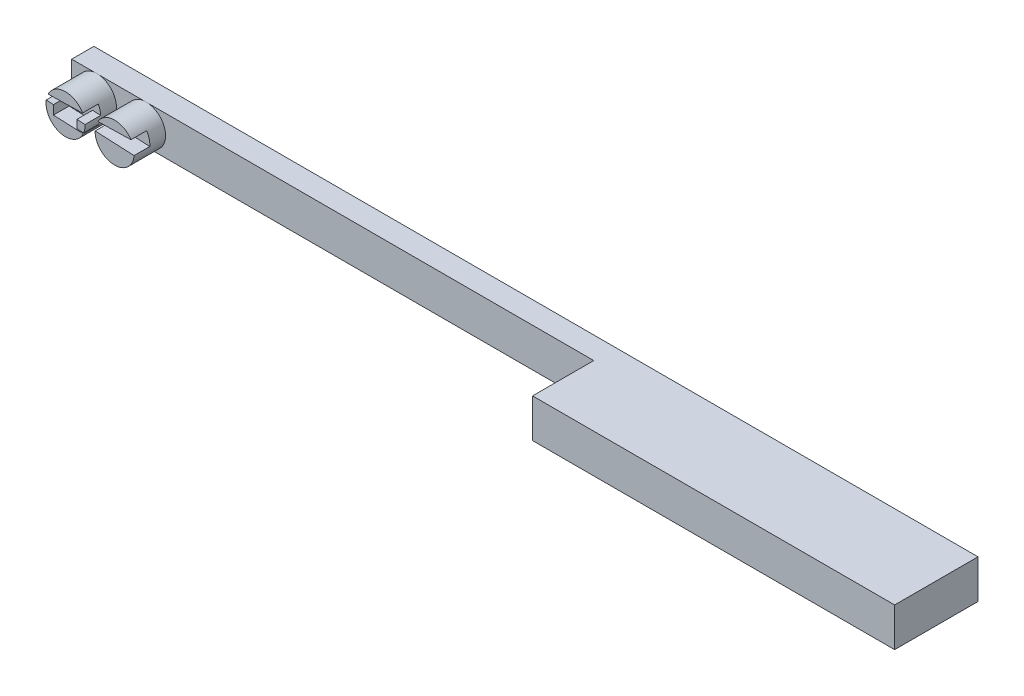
ISO-10303-21;
HEADER;
FILE_DESCRIPTION(('STEP AP214'),'2;1');
FILE_NAME('part.step','',(''),(''),'','','');
FILE_SCHEMA(('AUTOMOTIVE_DESIGN { 1 0 10303 214 1 1 1 1 }'));
ENDSEC;
DATA;
#1=APPLICATION_CONTEXT('core data for automotive mechanical design processes');
#2=APPLICATION_PROTOCOL_DEFINITION('international standard','automotive_design',2000,#1);
#3=PRODUCT_CONTEXT('',#1,'mechanical');
#4=PRODUCT('Part','Part','',(#3));
#5=PRODUCT_RELATED_PRODUCT_CATEGORY('part','',(#4));
#6=PRODUCT_DEFINITION_FORMATION('','',#4);
#7=PRODUCT_DEFINITION_CONTEXT('part definition',#1,'design');
#8=PRODUCT_DEFINITION('design','',#6,#7);
#9=PRODUCT_DEFINITION_SHAPE('','',#8);
#10=(LENGTH_UNIT() NAMED_UNIT(*) SI_UNIT(.MILLI.,.METRE.));
#11=(NAMED_UNIT(*) PLANE_ANGLE_UNIT() SI_UNIT($,.RADIAN.));
#12=(NAMED_UNIT(*) SI_UNIT($,.STERADIAN.) SOLID_ANGLE_UNIT());
#13=UNCERTAINTY_MEASURE_WITH_UNIT(LENGTH_MEASURE(1.E-05),#10,'distance_accuracy_value','');
#14=(GEOMETRIC_REPRESENTATION_CONTEXT(3) GLOBAL_UNCERTAINTY_ASSIGNED_CONTEXT((#13)) GLOBAL_UNIT_ASSIGNED_CONTEXT((#10,
#11,#12)) REPRESENTATION_CONTEXT('',''));
#15=CARTESIAN_POINT('',(0.,0.,0.));
#16=DIRECTION('',(0.,0.,1.));
#17=DIRECTION('',(1.,0.,0.));
#18=AXIS2_PLACEMENT_3D('',#15,#16,#17);
#19=CARTESIAN_POINT('',(-53.086,0.,3.8481));
#20=DIRECTION('',(0.,0.,1.));
#21=DIRECTION('',(1.,0.,0.));
#22=AXIS2_PLACEMENT_3D('',#19,#20,#21);
#23=PLANE('',#22);
#24=DIRECTION('',(-0.999733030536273,-0.0231055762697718,0.));
#25=VECTOR('',#24,1.);
#26=CARTESIAN_POINT('',(-35.97402,1.22303571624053,3.8481));
#27=LINE('',#26,#25);
#28=CARTESIAN_POINT('',(-51.5461047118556,0.863137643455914,3.8481));
#29=VERTEX_POINT('',#28);
#30=CARTESIAN_POINT('',(-54.6641270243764,0.791074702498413,3.8481));
#31=VERTEX_POINT('',#30);
#32=EDGE_CURVE('E322',#29,#31,#27,.T.);
#33=ORIENTED_EDGE('',*,*,#32,.F.);
#34=CARTESIAN_POINT('',(-53.086,0.,3.8481));
#35=DIRECTION('',(0.,0.,1.));
#36=DIRECTION('',(1.,0.,0.));
#37=AXIS2_PLACEMENT_3D('',#34,#35,#36);
#38=CIRCLE('',#37,1.7653);
#39=EDGE_CURVE('E221',#29,#31,#38,.T.);
#40=ORIENTED_EDGE('',*,*,#39,.T.);
#41=EDGE_LOOP('',(#33,#40));
#42=FACE_BOUND('',#41,.T.);
#43=ADVANCED_FACE('F34',(#42),#23,.T.);
#44=CARTESIAN_POINT('',(-48.641,0.,3.8481));
#45=DIRECTION('',(0.,0.,1.));
#46=DIRECTION('',(1.,0.,0.));
#47=AXIS2_PLACEMENT_3D('',#44,#45,#46);
#48=PLANE('',#47);
#49=DIRECTION('',(-0.999733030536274,-0.0231055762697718,0.));
#50=VECTOR('',#49,1.);
#51=CARTESIAN_POINT('',(-48.6624889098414,0.929783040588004,3.8481));
#52=LINE('',#51,#50);
#53=CARTESIAN_POINT('',(-47.1624476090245,0.96445161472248,3.8481));
#54=VERTEX_POINT('',#53);
#55=CARTESIAN_POINT('',(-50.1625302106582,0.895114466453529,3.8481));
#56=VERTEX_POINT('',#55);
#57=EDGE_CURVE('E294',#54,#56,#52,.T.);
#58=ORIENTED_EDGE('',*,*,#57,.F.);
#59=CARTESIAN_POINT('',(-48.641,0.,3.8481));
#60=DIRECTION('',(0.,0.,1.));
#61=DIRECTION('',(1.,0.,0.));
#62=AXIS2_PLACEMENT_3D('',#59,#60,#61);
#63=CIRCLE('',#62,1.76530000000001);
#64=EDGE_CURVE('E344',#54,#56,#63,.T.);
#65=ORIENTED_EDGE('',*,*,#64,.T.);
#66=EDGE_LOOP('',(#58,#65));
#67=FACE_BOUND('',#66,.T.);
#68=ADVANCED_FACE('F413',(#67),#48,.T.);
#69=CARTESIAN_POINT('',(-55.372,1.7526,1.0033));
#70=DIRECTION('',(0.,0.,-1.));
#71=DIRECTION('',(-1.,0.,0.));
#72=AXIS2_PLACEMENT_3D('',#69,#70,#71);
#73=PLANE('',#72);
#74=CARTESIAN_POINT('',(-48.641,0.,1.0033));
#75=DIRECTION('',(0.,0.,1.));
#76=DIRECTION('',(1.,0.,0.));
#77=AXIS2_PLACEMENT_3D('',#74,#75,#76);
#78=CIRCLE('',#77,1.76530000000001);
#79=CARTESIAN_POINT('',(-48.4296298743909,-1.7526,1.0033));
#80=VERTEX_POINT('',#79);
#81=CARTESIAN_POINT('',(-48.4296298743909,1.7526,1.0033));
#82=VERTEX_POINT('',#81);
#83=EDGE_CURVE('E343',#80,#82,#78,.T.);
#84=ORIENTED_EDGE('',*,*,#83,.F.);
#85=DIRECTION('',(1.,0.,0.));
#86=VECTOR('',#85,1.);
#87=CARTESIAN_POINT('',(-55.372,-1.7526,1.0033));
#88=LINE('',#87,#86);
#89=CARTESIAN_POINT('',(-8.128,-1.7526,1.0033));
#90=VERTEX_POINT('',#89);
#91=EDGE_CURVE('E261',#80,#90,#88,.T.);
#92=ORIENTED_EDGE('',*,*,#91,.T.);
#93=DIRECTION('',(0.,-1.,0.));
#94=VECTOR('',#93,1.);
#95=CARTESIAN_POINT('',(-8.128,1.7526,1.0033));
#96=LINE('',#95,#94);
#97=CARTESIAN_POINT('',(-8.128,1.7526,1.0033));
#98=VERTEX_POINT('',#97);
#99=EDGE_CURVE('E279',#98,#90,#96,.T.);
#100=ORIENTED_EDGE('',*,*,#99,.F.);
#101=DIRECTION('',(1.,0.,0.));
#102=VECTOR('',#101,1.);
#103=CARTESIAN_POINT('',(-55.372,1.7526,1.0033));
#104=LINE('',#103,#102);
#105=EDGE_CURVE('E245',#82,#98,#104,.T.);
#106=ORIENTED_EDGE('',*,*,#105,.F.);
#107=EDGE_LOOP('',(#84,#92,#100,#106));
#108=FACE_BOUND('',#107,.T.);
#109=ADVANCED_FACE('F418',(#108),#73,.F.);
#110=CARTESIAN_POINT('',(-48.8523701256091,1.7526,1.0033));
#111=VERTEX_POINT('',#110);
#112=CARTESIAN_POINT('',(-48.8523701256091,-1.7526,1.0033));
#113=VERTEX_POINT('',#112);
#114=EDGE_CURVE('E352',#111,#113,#78,.T.);
#115=ORIENTED_EDGE('',*,*,#114,.F.);
#116=CARTESIAN_POINT('',(-52.8746298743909,1.7526,1.0033));
#117=VERTEX_POINT('',#116);
#118=EDGE_CURVE('E250',#117,#111,#104,.T.);
#119=ORIENTED_EDGE('',*,*,#118,.F.);
#120=CARTESIAN_POINT('',(-53.086,0.,1.0033));
#121=DIRECTION('',(0.,0.,1.));
#122=DIRECTION('',(1.,0.,0.));
#123=AXIS2_PLACEMENT_3D('',#120,#121,#122);
#124=CIRCLE('',#123,1.7653);
#125=CARTESIAN_POINT('',(-52.8746298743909,-1.7526,1.0033));
#126=VERTEX_POINT('',#125);
#127=EDGE_CURVE('E235',#126,#117,#124,.T.);
#128=ORIENTED_EDGE('',*,*,#127,.F.);
#129=EDGE_CURVE('E709',#126,#113,#88,.T.);
#130=ORIENTED_EDGE('',*,*,#129,.T.);
#131=EDGE_LOOP('',(#115,#119,#128,#130));
#132=FACE_BOUND('',#131,.T.);
#133=ADVANCED_FACE('F425',(#132),#73,.F.);
#134=DIRECTION('',(0.99884275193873,-0.0480952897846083,0.));
#135=VECTOR('',#134,1.);
#136=CARTESIAN_POINT('',(-62.4332,0.611517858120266,3.8481));
#137=LINE('',#136,#135);
#138=CARTESIAN_POINT('',(-52.0598400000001,0.112030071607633,3.8481));
#139=VERTEX_POINT('',#138);
#140=CARTESIAN_POINT('',(-51.3223592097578,0.076519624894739,3.8481));
#141=VERTEX_POINT('',#140);
#142=EDGE_CURVE('E214',#139,#141,#137,.T.);
#143=ORIENTED_EDGE('',*,*,#142,.F.);
#144=DIRECTION('',(0.,1.,0.));
#145=VECTOR('',#144,1.);
#146=CARTESIAN_POINT('',(-52.0598400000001,-0.611517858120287,3.8481));
#147=LINE('',#146,#145);
#148=CARTESIAN_POINT('',(-52.0598400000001,-0.611517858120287,3.8481));
#149=VERTEX_POINT('',#148);
#150=EDGE_CURVE('E358',#149,#139,#147,.T.);
#151=ORIENTED_EDGE('',*,*,#150,.F.);
#152=DIRECTION('',(-0.998623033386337,0.0524598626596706,0.));
#153=VECTOR('',#152,1.);
#154=CARTESIAN_POINT('',(-53.1152119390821,-0.556076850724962,3.8481));
#155=LINE('',#154,#153);
#156=CARTESIAN_POINT('',(-51.4423441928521,-0.643956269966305,3.8481));
#157=VERTEX_POINT('',#156);
#158=EDGE_CURVE('E288',#157,#149,#155,.T.);
#159=ORIENTED_EDGE('',*,*,#158,.F.);
#160=EDGE_CURVE('E222',#157,#141,#38,.T.);
#161=ORIENTED_EDGE('',*,*,#160,.T.);
#162=EDGE_LOOP('',(#143,#151,#159,#161));
#163=FACE_BOUND('',#162,.T.);
#164=ADVANCED_FACE('F407',(#163),#23,.T.);
#165=CARTESIAN_POINT('',(-53.2973701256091,1.7526,1.0033));
#166=VERTEX_POINT('',#165);
#167=CARTESIAN_POINT('',(-53.2973701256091,-1.7526,1.0033));
#168=VERTEX_POINT('',#167);
#169=EDGE_CURVE('E234',#166,#168,#124,.T.);
#170=ORIENTED_EDGE('',*,*,#169,.F.);
#171=CARTESIAN_POINT('',(-55.372,1.7526,1.0033));
#172=VERTEX_POINT('',#171);
#173=EDGE_CURVE('E246',#172,#166,#104,.T.);
#174=ORIENTED_EDGE('',*,*,#173,.F.);
#175=DIRECTION('',(0.,-1.,0.));
#176=VECTOR('',#175,1.);
#177=CARTESIAN_POINT('',(-55.372,1.7526,1.0033));
#178=LINE('',#177,#176);
#179=CARTESIAN_POINT('',(-55.372,-1.7526,1.0033));
#180=VERTEX_POINT('',#179);
#181=EDGE_CURVE('E282',#172,#180,#178,.T.);
#182=ORIENTED_EDGE('',*,*,#181,.T.);
#183=EDGE_CURVE('E262',#180,#168,#88,.T.);
#184=ORIENTED_EDGE('',*,*,#183,.T.);
#185=EDGE_LOOP('',(#170,#174,#182,#184));
#186=FACE_BOUND('',#185,.T.);
#187=ADVANCED_FACE('F387',(#186),#73,.F.);
#188=CARTESIAN_POINT('',(24.638,1.7526,-1.0033));
#189=DIRECTION('',(0.,0.,1.));
#190=DIRECTION('',(1.,0.,0.));
#191=AXIS2_PLACEMENT_3D('',#188,#189,#190);
#192=PLANE('',#191);
#193=DIRECTION('',(-1.,0.,0.));
#194=VECTOR('',#193,1.);
#195=CARTESIAN_POINT('',(24.638,-1.7526,-1.0033));
#196=LINE('',#195,#194);
#197=CARTESIAN_POINT('',(24.638,-1.7526,-1.0033));
#198=VERTEX_POINT('',#197);
#199=CARTESIAN_POINT('',(-55.372,-1.7526,-1.0033));
#200=VERTEX_POINT('',#199);
#201=EDGE_CURVE('E238',#198,#200,#196,.T.);
#202=ORIENTED_EDGE('',*,*,#201,.T.);
#203=DIRECTION('',(0.,-1.,0.));
#204=VECTOR('',#203,1.);
#205=CARTESIAN_POINT('',(-55.372,1.7526,-1.0033));
#206=LINE('',#205,#204);
#207=CARTESIAN_POINT('',(-55.372,1.7526,-1.0033));
#208=VERTEX_POINT('',#207);
#209=EDGE_CURVE('E285',#208,#200,#206,.T.);
#210=ORIENTED_EDGE('',*,*,#209,.F.);
#211=DIRECTION('',(-1.,0.,0.));
#212=VECTOR('',#211,1.);
#213=CARTESIAN_POINT('',(24.638,1.7526,-1.0033));
#214=LINE('',#213,#212);
#215=CARTESIAN_POINT('',(24.638,1.7526,-1.0033));
#216=VERTEX_POINT('',#215);
#217=EDGE_CURVE('E239',#216,#208,#214,.T.);
#218=ORIENTED_EDGE('',*,*,#217,.F.);
#219=DIRECTION('',(0.,-1.,0.));
#220=VECTOR('',#219,1.);
#221=CARTESIAN_POINT('',(24.638,1.7526,-1.0033));
#222=LINE('',#221,#220);
#223=EDGE_CURVE('E256',#216,#198,#222,.T.);
#224=ORIENTED_EDGE('',*,*,#223,.T.);
#225=EDGE_LOOP('',(#202,#210,#218,#224));
#226=FACE_BOUND('',#225,.T.);
#227=ADVANCED_FACE('F36',(#226),#192,.F.);
#228=CARTESIAN_POINT('',(-55.372,1.7526,-1.0033));
#229=DIRECTION('',(1.,0.,0.));
#230=DIRECTION('',(0.,0.,-1.));
#231=AXIS2_PLACEMENT_3D('',#228,#229,#230);
#232=PLANE('',#231);
#233=DIRECTION('',(0.,0.,1.));
#234=VECTOR('',#233,1.);
#235=CARTESIAN_POINT('',(-55.372,-1.7526,-1.0033));
#236=LINE('',#235,#234);
#237=EDGE_CURVE('E259',#200,#180,#236,.T.);
#238=ORIENTED_EDGE('',*,*,#237,.T.);
#239=ORIENTED_EDGE('',*,*,#181,.F.);
#240=DIRECTION('',(0.,0.,1.));
#241=VECTOR('',#240,1.);
#242=CARTESIAN_POINT('',(-55.372,1.7526,-1.0033));
#243=LINE('',#242,#241);
#244=EDGE_CURVE('E242',#208,#172,#243,.T.);
#245=ORIENTED_EDGE('',*,*,#244,.F.);
#246=ORIENTED_EDGE('',*,*,#209,.T.);
#247=EDGE_LOOP('',(#238,#239,#245,#246));
#248=FACE_BOUND('',#247,.T.);
#249=ADVANCED_FACE('F672',(#248),#232,.F.);
#250=CARTESIAN_POINT('',(-8.128,1.7526,1.0033));
#251=DIRECTION('',(1.,0.,0.));
#252=DIRECTION('',(0.,0.,-1.));
#253=AXIS2_PLACEMENT_3D('',#250,#251,#252);
#254=PLANE('',#253);
#255=DIRECTION('',(0.,0.,1.));
#256=VECTOR('',#255,1.);
#257=CARTESIAN_POINT('',(-8.128,-1.7526,1.0033));
#258=LINE('',#257,#256);
#259=CARTESIAN_POINT('',(-8.128,-1.7526,6.5405));
#260=VERTEX_POINT('',#259);
#261=EDGE_CURVE('E265',#90,#260,#258,.T.);
#262=ORIENTED_EDGE('',*,*,#261,.T.);
#263=DIRECTION('',(0.,-1.,0.));
#264=VECTOR('',#263,1.);
#265=CARTESIAN_POINT('',(-8.128,1.7526,6.5405));
#266=LINE('',#265,#264);
#267=CARTESIAN_POINT('',(-8.128,1.7526,6.5405));
#268=VERTEX_POINT('',#267);
#269=EDGE_CURVE('E276',#268,#260,#266,.T.);
#270=ORIENTED_EDGE('',*,*,#269,.F.);
#271=DIRECTION('',(0.,0.,1.));
#272=VECTOR('',#271,1.);
#273=CARTESIAN_POINT('',(-8.128,1.7526,1.0033));
#274=LINE('',#273,#272);
#275=EDGE_CURVE('E249',#98,#268,#274,.T.);
#276=ORIENTED_EDGE('',*,*,#275,.F.);
#277=ORIENTED_EDGE('',*,*,#99,.T.);
#278=EDGE_LOOP('',(#262,#270,#276,#277));
#279=FACE_BOUND('',#278,.T.);
#280=ADVANCED_FACE('F662',(#279),#254,.F.);
#281=CARTESIAN_POINT('',(-8.128,1.7526,6.5405));
#282=DIRECTION('',(0.,0.,-1.));
#283=DIRECTION('',(-1.,0.,0.));
#284=AXIS2_PLACEMENT_3D('',#281,#282,#283);
#285=PLANE('',#284);
#286=DIRECTION('',(1.,0.,0.));
#287=VECTOR('',#286,1.);
#288=CARTESIAN_POINT('',(-8.128,-1.7526,6.5405));
#289=LINE('',#288,#287);
#290=CARTESIAN_POINT('',(24.638,-1.7526,6.5405));
#291=VERTEX_POINT('',#290);
#292=EDGE_CURVE('E268',#260,#291,#289,.T.);
#293=ORIENTED_EDGE('',*,*,#292,.T.);
#294=DIRECTION('',(0.,-1.,0.));
#295=VECTOR('',#294,1.);
#296=CARTESIAN_POINT('',(24.638,1.7526,6.5405));
#297=LINE('',#296,#295);
#298=CARTESIAN_POINT('',(24.638,1.7526,6.5405));
#299=VERTEX_POINT('',#298);
#300=EDGE_CURVE('E273',#299,#291,#297,.T.);
#301=ORIENTED_EDGE('',*,*,#300,.F.);
#302=DIRECTION('',(1.,0.,0.));
#303=VECTOR('',#302,1.);
#304=CARTESIAN_POINT('',(-8.128,1.7526,6.5405));
#305=LINE('',#304,#303);
#306=EDGE_CURVE('E252',#268,#299,#305,.T.);
#307=ORIENTED_EDGE('',*,*,#306,.F.);
#308=ORIENTED_EDGE('',*,*,#269,.T.);
#309=EDGE_LOOP('',(#293,#301,#307,#308));
#310=FACE_BOUND('',#309,.T.);
#311=ADVANCED_FACE('F652',(#310),#285,.F.);
#312=CARTESIAN_POINT('',(24.638,1.7526,6.5405));
#313=DIRECTION('',(-1.,0.,0.));
#314=DIRECTION('',(0.,0.,1.));
#315=AXIS2_PLACEMENT_3D('',#312,#313,#314);
#316=PLANE('',#315);
#317=DIRECTION('',(0.,0.,-1.));
#318=VECTOR('',#317,1.);
#319=CARTESIAN_POINT('',(24.638,-1.7526,6.5405));
#320=LINE('',#319,#318);
#321=EDGE_CURVE('E243',#291,#198,#320,.T.);
#322=ORIENTED_EDGE('',*,*,#321,.T.);
#323=ORIENTED_EDGE('',*,*,#223,.F.);
#324=DIRECTION('',(0.,0.,-1.));
#325=VECTOR('',#324,1.);
#326=CARTESIAN_POINT('',(24.638,1.7526,6.5405));
#327=LINE('',#326,#325);
#328=EDGE_CURVE('E254',#299,#216,#327,.T.);
#329=ORIENTED_EDGE('',*,*,#328,.F.);
#330=ORIENTED_EDGE('',*,*,#300,.T.);
#331=EDGE_LOOP('',(#322,#323,#329,#330));
#332=FACE_BOUND('',#331,.T.);
#333=ADVANCED_FACE('F607',(#332),#316,.F.);
#334=CARTESIAN_POINT('',(-55.372,1.7526,-1.0033));
#335=DIRECTION('',(0.,1.,0.));
#336=DIRECTION('',(0.,0.,1.));
#337=AXIS2_PLACEMENT_3D('',#334,#335,#336);
#338=PLANE('',#337);
#339=ORIENTED_EDGE('',*,*,#217,.T.);
#340=ORIENTED_EDGE('',*,*,#244,.T.);
#341=ORIENTED_EDGE('',*,*,#173,.T.);
#342=DIRECTION('',(1.,0.,0.));
#343=VECTOR('',#342,1.);
#344=CARTESIAN_POINT('',(-55.372,1.7526,1.0033));
#345=LINE('',#344,#343);
#346=EDGE_CURVE('E225',#166,#117,#345,.T.);
#347=ORIENTED_EDGE('',*,*,#346,.T.);
#348=ORIENTED_EDGE('',*,*,#118,.T.);
#349=DIRECTION('',(1.,0.,0.));
#350=VECTOR('',#349,1.);
#351=CARTESIAN_POINT('',(-55.372,1.7526,1.0033));
#352=LINE('',#351,#350);
#353=EDGE_CURVE('E347',#111,#82,#352,.T.);
#354=ORIENTED_EDGE('',*,*,#353,.T.);
#355=ORIENTED_EDGE('',*,*,#105,.T.);
#356=ORIENTED_EDGE('',*,*,#275,.T.);
#357=ORIENTED_EDGE('',*,*,#306,.T.);
#358=ORIENTED_EDGE('',*,*,#328,.T.);
#359=EDGE_LOOP('',(#339,#340,#341,#347,#348,#354,#355,#356,#357,#358));
#360=FACE_BOUND('',#359,.T.);
#361=ADVANCED_FACE('F391',(#360),#338,.T.);
#362=CARTESIAN_POINT('',(-55.372,-1.7526,-1.0033));
#363=DIRECTION('',(0.,1.,0.));
#364=DIRECTION('',(0.,0.,1.));
#365=AXIS2_PLACEMENT_3D('',#362,#363,#364);
#366=PLANE('',#365);
#367=ORIENTED_EDGE('',*,*,#201,.F.);
#368=ORIENTED_EDGE('',*,*,#321,.F.);
#369=ORIENTED_EDGE('',*,*,#292,.F.);
#370=ORIENTED_EDGE('',*,*,#261,.F.);
#371=ORIENTED_EDGE('',*,*,#91,.F.);
#372=EDGE_CURVE('E708',#113,#80,#88,.T.);
#373=ORIENTED_EDGE('',*,*,#372,.F.);
#374=ORIENTED_EDGE('',*,*,#129,.F.);
#375=EDGE_CURVE('E266',#168,#126,#88,.T.);
#376=ORIENTED_EDGE('',*,*,#375,.F.);
#377=ORIENTED_EDGE('',*,*,#183,.F.);
#378=ORIENTED_EDGE('',*,*,#237,.F.);
#379=EDGE_LOOP('',(#367,#368,#369,#370,#371,#373,#374,#376,#377,#378));
#380=FACE_BOUND('',#379,.T.);
#381=ADVANCED_FACE('F410',(#380),#366,.F.);
#382=CARTESIAN_POINT('',(-53.086,0.,1.0033));
#383=DIRECTION('',(0.,0.,1.));
#384=DIRECTION('',(1.,0.,0.));
#385=AXIS2_PLACEMENT_3D('',#382,#383,#384);
#386=PLANE('',#385);
#387=EDGE_CURVE('E379',#168,#126,#124,.T.);
#388=ORIENTED_EDGE('',*,*,#387,.F.);
#389=ORIENTED_EDGE('',*,*,#375,.T.);
#390=EDGE_LOOP('',(#388,#389));
#391=FACE_BOUND('',#390,.T.);
#392=ADVANCED_FACE('F399',(#391),#386,.F.);
#393=CARTESIAN_POINT('',(-53.086,0.,3.8481));
#394=DIRECTION('',(0.,0.,-1.));
#395=DIRECTION('',(-1.,0.,0.));
#396=AXIS2_PLACEMENT_3D('',#393,#394,#395);
#397=CYLINDRICAL_SURFACE('',#396,1.7653);
#398=CARTESIAN_POINT('',(-53.086,0.,2.4257));
#399=DIRECTION('',(0.,0.,1.));
#400=DIRECTION('',(1.,0.,0.));
#401=AXIS2_PLACEMENT_3D('',#398,#399,#400);
#402=CIRCLE('',#401,1.7653);
#403=CARTESIAN_POINT('',(-51.3223592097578,0.076519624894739,2.4257));
#404=VERTEX_POINT('',#403);
#405=CARTESIAN_POINT('',(-51.5461047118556,0.863137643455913,2.4257));
#406=VERTEX_POINT('',#405);
#407=EDGE_CURVE('E292',#404,#406,#402,.T.);
#408=ORIENTED_EDGE('',*,*,#407,.F.);
#409=DIRECTION('',(0.,0.,-1.));
#410=VECTOR('',#409,1.);
#411=CARTESIAN_POINT('',(-51.3223592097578,0.076519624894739,3.8481));
#412=LINE('',#411,#410);
#413=EDGE_CURVE('E204',#404,#141,#412,.F.);
#414=ORIENTED_EDGE('',*,*,#413,.T.);
#415=ORIENTED_EDGE('',*,*,#160,.F.);
#416=DIRECTION('',(0.,0.,-1.));
#417=VECTOR('',#416,1.);
#418=CARTESIAN_POINT('',(-51.4423441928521,-0.643956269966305,3.8481));
#419=LINE('',#418,#417);
#420=CARTESIAN_POINT('',(-51.4423441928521,-0.643956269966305,2.4257));
#421=VERTEX_POINT('',#420);
#422=EDGE_CURVE('E230',#157,#421,#419,.T.);
#423=ORIENTED_EDGE('',*,*,#422,.T.);
#424=CARTESIAN_POINT('',(-51.479375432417,-0.731465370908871,2.4257));
#425=VERTEX_POINT('',#424);
#426=EDGE_CURVE('E290',#425,#421,#402,.T.);
#427=ORIENTED_EDGE('',*,*,#426,.F.);
#428=DIRECTION('',(0.,0.,-1.));
#429=VECTOR('',#428,1.);
#430=CARTESIAN_POINT('',(-51.479375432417,-0.731465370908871,3.8481));
#431=LINE('',#430,#429);
#432=CARTESIAN_POINT('',(-51.479375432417,-0.731465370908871,3.8481));
#433=VERTEX_POINT('',#432);
#434=EDGE_CURVE('E220',#425,#433,#431,.F.);
#435=ORIENTED_EDGE('',*,*,#434,.T.);
#436=CARTESIAN_POINT('',(-54.8341296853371,0.245614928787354,3.8481));
#437=VERTEX_POINT('',#436);
#438=EDGE_CURVE('E210',#437,#433,#38,.T.);
#439=ORIENTED_EDGE('',*,*,#438,.F.);
#440=DIRECTION('',(0.,0.,-1.));
#441=VECTOR('',#440,1.);
#442=CARTESIAN_POINT('',(-54.8341296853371,0.245614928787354,3.8481));
#443=LINE('',#442,#441);
#444=CARTESIAN_POINT('',(-54.8341296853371,0.245614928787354,2.4257));
#445=VERTEX_POINT('',#444);
#446=EDGE_CURVE('E195',#437,#445,#443,.T.);
#447=ORIENTED_EDGE('',*,*,#446,.T.);
#448=CARTESIAN_POINT('',(-53.086,0.,2.4257));
#449=DIRECTION('',(0.,0.,-1.));
#450=DIRECTION('',(-1.,0.,0.));
#451=AXIS2_PLACEMENT_3D('',#448,#449,#450);
#452=CIRCLE('',#451,1.7653);
#453=CARTESIAN_POINT('',(-54.6641270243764,0.791074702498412,2.4257));
#454=VERTEX_POINT('',#453);
#455=EDGE_CURVE('E341',#445,#454,#452,.T.);
#456=ORIENTED_EDGE('',*,*,#455,.T.);
#457=DIRECTION('',(0.,0.,-1.));
#458=VECTOR('',#457,1.);
#459=CARTESIAN_POINT('',(-54.6641270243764,0.791074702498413,3.8481));
#460=LINE('',#459,#458);
#461=EDGE_CURVE('E335',#454,#31,#460,.F.);
#462=ORIENTED_EDGE('',*,*,#461,.T.);
#463=ORIENTED_EDGE('',*,*,#39,.F.);
#464=DIRECTION('',(0.,0.,-1.));
#465=VECTOR('',#464,1.);
#466=CARTESIAN_POINT('',(-51.5461047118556,0.863137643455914,3.8481));
#467=LINE('',#466,#465);
#468=EDGE_CURVE('E338',#29,#406,#467,.T.);
#469=ORIENTED_EDGE('',*,*,#468,.T.);
#470=EDGE_LOOP('',(#408,#414,#415,#423,#427,#435,#439,#447,#456,#462,#463,#469));
#471=FACE_BOUND('',#470,.T.);
#472=EDGE_CURVE('E227',#117,#166,#124,.T.);
#473=ORIENTED_EDGE('',*,*,#472,.T.);
#474=ORIENTED_EDGE('',*,*,#169,.T.);
#475=ORIENTED_EDGE('',*,*,#387,.T.);
#476=ORIENTED_EDGE('',*,*,#127,.T.);
#477=EDGE_LOOP('',(#473,#474,#475,#476));
#478=FACE_BOUND('',#477,.T.);
#479=ADVANCED_FACE('F217',(#471,#478),#397,.T.);
#480=CARTESIAN_POINT('',(-54.1782,0.214031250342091,3.8481));
#481=VERTEX_POINT('',#480);
#482=EDGE_CURVE('E198',#437,#481,#137,.T.);
#483=ORIENTED_EDGE('',*,*,#482,.F.);
#484=ORIENTED_EDGE('',*,*,#438,.T.);
#485=DIRECTION('',(0.999013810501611,-0.044400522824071,0.));
#486=VECTOR('',#485,1.);
#487=CARTESIAN_POINT('',(-54.1782,-0.61151785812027,3.8481));
#488=LINE('',#487,#486);
#489=CARTESIAN_POINT('',(-54.1782,-0.61151785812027,3.8481));
#490=VERTEX_POINT('',#489);
#491=EDGE_CURVE('E368',#490,#433,#488,.T.);
#492=ORIENTED_EDGE('',*,*,#491,.F.);
#493=DIRECTION('',(0.,-1.,0.));
#494=VECTOR('',#493,1.);
#495=CARTESIAN_POINT('',(-54.1782,0.61151785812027,3.8481));
#496=LINE('',#495,#494);
#497=EDGE_CURVE('E212',#481,#490,#496,.T.);
#498=ORIENTED_EDGE('',*,*,#497,.F.);
#499=EDGE_LOOP('',(#483,#484,#492,#498));
#500=FACE_BOUND('',#499,.T.);
#501=ADVANCED_FACE('F208',(#500),#23,.T.);
#502=ORIENTED_EDGE('',*,*,#346,.F.);
#503=ORIENTED_EDGE('',*,*,#472,.F.);
#504=EDGE_LOOP('',(#502,#503));
#505=FACE_BOUND('',#504,.T.);
#506=ADVANCED_FACE('F395',(#505),#386,.F.);
#507=CARTESIAN_POINT('',(-54.1782,0.61151785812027,2.4257));
#508=DIRECTION('',(0.,0.,1.));
#509=DIRECTION('',(1.,0.,0.));
#510=AXIS2_PLACEMENT_3D('',#507,#508,#509);
#511=PLANE('',#510);
#512=DIRECTION('',(0.,1.,0.));
#513=VECTOR('',#512,1.);
#514=CARTESIAN_POINT('',(-52.0598400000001,-0.611517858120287,2.4257));
#515=LINE('',#514,#513);
#516=CARTESIAN_POINT('',(-52.0598400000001,-0.611517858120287,2.4257));
#517=VERTEX_POINT('',#516);
#518=CARTESIAN_POINT('',(-52.0598400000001,0.112030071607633,2.4257));
#519=VERTEX_POINT('',#518);
#520=EDGE_CURVE('E363',#517,#519,#515,.T.);
#521=ORIENTED_EDGE('',*,*,#520,.T.);
#522=DIRECTION('',(0.99884275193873,-0.0480952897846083,0.));
#523=VECTOR('',#522,1.);
#524=CARTESIAN_POINT('',(-62.4332,0.611517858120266,2.4257));
#525=LINE('',#524,#523);
#526=EDGE_CURVE('E318',#519,#404,#525,.T.);
#527=ORIENTED_EDGE('',*,*,#526,.T.);
#528=ORIENTED_EDGE('',*,*,#407,.T.);
#529=DIRECTION('',(-0.999733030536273,-0.0231055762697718,0.));
#530=VECTOR('',#529,1.);
#531=CARTESIAN_POINT('',(-35.97402,1.22303571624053,2.4257));
#532=LINE('',#531,#530);
#533=EDGE_CURVE('E213',#406,#454,#532,.T.);
#534=ORIENTED_EDGE('',*,*,#533,.T.);
#535=ORIENTED_EDGE('',*,*,#455,.F.);
#536=CARTESIAN_POINT('',(-54.1782,0.214031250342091,2.4257));
#537=VERTEX_POINT('',#536);
#538=EDGE_CURVE('E49',#445,#537,#525,.T.);
#539=ORIENTED_EDGE('',*,*,#538,.T.);
#540=DIRECTION('',(0.,-1.,0.));
#541=VECTOR('',#540,1.);
#542=CARTESIAN_POINT('',(-54.1782,0.61151785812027,2.4257));
#543=LINE('',#542,#541);
#544=CARTESIAN_POINT('',(-54.1782,-0.61151785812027,2.4257));
#545=VERTEX_POINT('',#544);
#546=EDGE_CURVE('E355',#537,#545,#543,.T.);
#547=ORIENTED_EDGE('',*,*,#546,.T.);
#548=DIRECTION('',(0.999013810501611,-0.044400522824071,0.));
#549=VECTOR('',#548,1.);
#550=CARTESIAN_POINT('',(-54.1782,-0.61151785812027,2.4257));
#551=LINE('',#550,#549);
#552=EDGE_CURVE('E357',#545,#425,#551,.T.);
#553=ORIENTED_EDGE('',*,*,#552,.T.);
#554=ORIENTED_EDGE('',*,*,#426,.T.);
#555=DIRECTION('',(-0.998623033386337,0.0524598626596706,0.));
#556=VECTOR('',#555,1.);
#557=CARTESIAN_POINT('',(-40.41902,-1.22303571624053,2.4257));
#558=LINE('',#557,#556);
#559=EDGE_CURVE('E361',#421,#517,#558,.T.);
#560=ORIENTED_EDGE('',*,*,#559,.T.);
#561=EDGE_LOOP('',(#521,#527,#528,#534,#535,#539,#547,#553,#554,#560));
#562=FACE_BOUND('',#561,.T.);
#563=ADVANCED_FACE('F397',(#562),#511,.T.);
#564=CARTESIAN_POINT('',(-40.41902,-1.22303571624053,2.4257));
#565=DIRECTION('',(0.0524598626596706,0.998623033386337,0.));
#566=DIRECTION('',(-0.998623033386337,0.0524598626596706,0.));
#567=AXIS2_PLACEMENT_3D('',#564,#565,#566);
#568=PLANE('',#567);
#569=ORIENTED_EDGE('',*,*,#158,.T.);
#570=DIRECTION('',(0.,0.,1.));
#571=VECTOR('',#570,1.);
#572=CARTESIAN_POINT('',(-52.0598400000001,-0.611517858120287,2.4257));
#573=LINE('',#572,#571);
#574=EDGE_CURVE('E372',#517,#149,#573,.T.);
#575=ORIENTED_EDGE('',*,*,#574,.F.);
#576=ORIENTED_EDGE('',*,*,#559,.F.);
#577=ORIENTED_EDGE('',*,*,#422,.F.);
#578=EDGE_LOOP('',(#569,#575,#576,#577));
#579=FACE_BOUND('',#578,.T.);
#580=ADVANCED_FACE('F404',(#579),#568,.F.);
#581=CARTESIAN_POINT('',(-54.1782,-0.61151785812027,2.4257));
#582=DIRECTION('',(-0.044400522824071,-0.999013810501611,0.));
#583=DIRECTION('',(0.999013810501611,-0.044400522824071,0.));
#584=AXIS2_PLACEMENT_3D('',#581,#582,#583);
#585=PLANE('',#584);
#586=ORIENTED_EDGE('',*,*,#552,.F.);
#587=DIRECTION('',(0.,0.,1.));
#588=VECTOR('',#587,1.);
#589=CARTESIAN_POINT('',(-54.1782,-0.61151785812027,2.4257));
#590=LINE('',#589,#588);
#591=EDGE_CURVE('E366',#545,#490,#590,.T.);
#592=ORIENTED_EDGE('',*,*,#591,.T.);
#593=ORIENTED_EDGE('',*,*,#491,.T.);
#594=ORIENTED_EDGE('',*,*,#434,.F.);
#595=EDGE_LOOP('',(#586,#592,#593,#594));
#596=FACE_BOUND('',#595,.T.);
#597=ADVANCED_FACE('F451',(#596),#585,.F.);
#598=CARTESIAN_POINT('',(-52.0598400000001,-0.611517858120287,2.4257));
#599=DIRECTION('',(1.,0.,0.));
#600=DIRECTION('',(0.,0.,-1.));
#601=AXIS2_PLACEMENT_3D('',#598,#599,#600);
#602=PLANE('',#601);
#603=ORIENTED_EDGE('',*,*,#150,.T.);
#604=DIRECTION('',(0.,0.,-1.));
#605=VECTOR('',#604,1.);
#606=CARTESIAN_POINT('',(-52.0598400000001,0.112030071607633,2.4257));
#607=LINE('',#606,#605);
#608=EDGE_CURVE('E328',#139,#519,#607,.T.);
#609=ORIENTED_EDGE('',*,*,#608,.T.);
#610=ORIENTED_EDGE('',*,*,#520,.F.);
#611=ORIENTED_EDGE('',*,*,#574,.T.);
#612=EDGE_LOOP('',(#603,#609,#610,#611));
#613=FACE_BOUND('',#612,.T.);
#614=ADVANCED_FACE('F439',(#613),#602,.F.);
#615=CARTESIAN_POINT('',(-54.1782,0.61151785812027,2.4257));
#616=DIRECTION('',(-1.,0.,0.));
#617=DIRECTION('',(0.,0.,1.));
#618=AXIS2_PLACEMENT_3D('',#615,#616,#617);
#619=PLANE('',#618);
#620=ORIENTED_EDGE('',*,*,#546,.F.);
#621=DIRECTION('',(0.,0.,1.));
#622=VECTOR('',#621,1.);
#623=CARTESIAN_POINT('',(-54.1782,0.214031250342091,2.4257));
#624=LINE('',#623,#622);
#625=EDGE_CURVE('E326',#537,#481,#624,.T.);
#626=ORIENTED_EDGE('',*,*,#625,.T.);
#627=ORIENTED_EDGE('',*,*,#497,.T.);
#628=ORIENTED_EDGE('',*,*,#591,.F.);
#629=EDGE_LOOP('',(#620,#626,#627,#628));
#630=FACE_BOUND('',#629,.T.);
#631=ADVANCED_FACE('F453',(#630),#619,.F.);
#632=CARTESIAN_POINT('',(-48.641,0.,1.0033));
#633=DIRECTION('',(0.,0.,1.));
#634=DIRECTION('',(1.,0.,0.));
#635=AXIS2_PLACEMENT_3D('',#632,#633,#634);
#636=PLANE('',#635);
#637=EDGE_CURVE('E717',#113,#80,#78,.T.);
#638=ORIENTED_EDGE('',*,*,#637,.F.);
#639=ORIENTED_EDGE('',*,*,#372,.T.);
#640=EDGE_LOOP('',(#638,#639));
#641=FACE_BOUND('',#640,.T.);
#642=ADVANCED_FACE('F455',(#641),#636,.F.);
#643=CARTESIAN_POINT('',(-48.641,0.,3.8481));
#644=DIRECTION('',(0.,0.,-1.));
#645=DIRECTION('',(-1.,0.,0.));
#646=AXIS2_PLACEMENT_3D('',#643,#644,#645);
#647=CYLINDRICAL_SURFACE('',#646,1.76530000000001);
#648=CARTESIAN_POINT('',(-48.641,0.,2.4257));
#649=DIRECTION('',(0.,0.,-1.));
#650=DIRECTION('',(-1.,0.,0.));
#651=AXIS2_PLACEMENT_3D('',#648,#649,#650);
#652=CIRCLE('',#651,1.76530000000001);
#653=CARTESIAN_POINT('',(-50.4060027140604,0.0323961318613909,2.4257));
#654=VERTEX_POINT('',#653);
#655=CARTESIAN_POINT('',(-50.1625302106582,0.895114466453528,2.4257));
#656=VERTEX_POINT('',#655);
#657=EDGE_CURVE('E12',#654,#656,#652,.T.);
#658=ORIENTED_EDGE('',*,*,#657,.T.);
#659=DIRECTION('',(0.,0.,-1.));
#660=VECTOR('',#659,1.);
#661=CARTESIAN_POINT('',(-50.1625302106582,0.895114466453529,3.8481));
#662=LINE('',#661,#660);
#663=EDGE_CURVE('E203',#656,#56,#662,.F.);
#664=ORIENTED_EDGE('',*,*,#663,.T.);
#665=ORIENTED_EDGE('',*,*,#64,.F.);
#666=DIRECTION('',(0.,0.,-1.));
#667=VECTOR('',#666,1.);
#668=CARTESIAN_POINT('',(-47.1624476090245,0.96445161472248,3.8481));
#669=LINE('',#668,#667);
#670=CARTESIAN_POINT('',(-47.1624476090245,0.96445161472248,2.4257));
#671=VERTEX_POINT('',#670);
#672=EDGE_CURVE('E308',#54,#671,#669,.T.);
#673=ORIENTED_EDGE('',*,*,#672,.T.);
#674=CARTESIAN_POINT('',(-46.8810501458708,-0.137333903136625,2.4257));
#675=VERTEX_POINT('',#674);
#676=EDGE_CURVE('E38',#671,#675,#652,.T.);
#677=ORIENTED_EDGE('',*,*,#676,.T.);
#678=DIRECTION('',(0.,0.,-1.));
#679=VECTOR('',#678,1.);
#680=CARTESIAN_POINT('',(-46.8810501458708,-0.137333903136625,3.8481));
#681=LINE('',#680,#679);
#682=CARTESIAN_POINT('',(-46.8810501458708,-0.137333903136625,3.8481));
#683=VERTEX_POINT('',#682);
#684=EDGE_CURVE('E305',#675,#683,#681,.F.);
#685=ORIENTED_EDGE('',*,*,#684,.T.);
#686=CARTESIAN_POINT('',(-50.4060027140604,0.032396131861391,3.8481));
#687=VERTEX_POINT('',#686);
#688=EDGE_CURVE('E348',#687,#683,#63,.T.);
#689=ORIENTED_EDGE('',*,*,#688,.F.);
#690=DIRECTION('',(0.,0.,-1.));
#691=VECTOR('',#690,1.);
#692=CARTESIAN_POINT('',(-50.4060027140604,0.0323961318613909,3.8481));
#693=LINE('',#692,#691);
#694=EDGE_CURVE('E57',#687,#654,#693,.T.);
#695=ORIENTED_EDGE('',*,*,#694,.T.);
#696=EDGE_LOOP('',(#658,#664,#665,#673,#677,#685,#689,#695));
#697=FACE_BOUND('',#696,.T.);
#698=EDGE_CURVE('E349',#82,#111,#78,.T.);
#699=ORIENTED_EDGE('',*,*,#698,.T.);
#700=ORIENTED_EDGE('',*,*,#114,.T.);
#701=ORIENTED_EDGE('',*,*,#637,.T.);
#702=ORIENTED_EDGE('',*,*,#83,.T.);
#703=EDGE_LOOP('',(#699,#700,#701,#702));
#704=FACE_BOUND('',#703,.T.);
#705=ADVANCED_FACE('F302',(#697,#704),#647,.T.);
#706=DIRECTION('',(0.99884275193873,-0.0480952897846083,0.));
#707=VECTOR('',#706,1.);
#708=CARTESIAN_POINT('',(-48.6435264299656,-0.0524688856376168,3.8481));
#709=LINE('',#708,#707);
#710=EDGE_CURVE('E293',#687,#683,#709,.T.);
#711=ORIENTED_EDGE('',*,*,#710,.F.);
#712=ORIENTED_EDGE('',*,*,#688,.T.);
#713=EDGE_LOOP('',(#711,#712));
#714=FACE_BOUND('',#713,.T.);
#715=ADVANCED_FACE('F421',(#714),#48,.T.);
#716=ORIENTED_EDGE('',*,*,#353,.F.);
#717=ORIENTED_EDGE('',*,*,#698,.F.);
#718=EDGE_LOOP('',(#716,#717));
#719=FACE_BOUND('',#718,.T.);
#720=ADVANCED_FACE('F462',(#719),#636,.F.);
#721=CARTESIAN_POINT('',(-35.97402,1.22303571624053,2.4257));
#722=DIRECTION('',(-0.0231055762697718,0.999733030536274,0.));
#723=DIRECTION('',(-0.999733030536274,-0.0231055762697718,0.));
#724=AXIS2_PLACEMENT_3D('',#721,#722,#723);
#725=PLANE('',#724);
#726=ORIENTED_EDGE('',*,*,#57,.T.);
#727=ORIENTED_EDGE('',*,*,#663,.F.);
#728=EDGE_CURVE('E314',#671,#656,#532,.T.);
#729=ORIENTED_EDGE('',*,*,#728,.F.);
#730=ORIENTED_EDGE('',*,*,#672,.F.);
#731=EDGE_LOOP('',(#726,#727,#729,#730));
#732=FACE_BOUND('',#731,.T.);
#733=ADVANCED_FACE('F316',(#732),#725,.F.);
#734=CARTESIAN_POINT('',(-62.4332,0.611517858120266,2.4257));
#735=DIRECTION('',(-0.0480952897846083,-0.99884275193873,0.));
#736=DIRECTION('',(0.99884275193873,-0.0480952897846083,0.));
#737=AXIS2_PLACEMENT_3D('',#734,#735,#736);
#738=PLANE('',#737);
#739=ORIENTED_EDGE('',*,*,#710,.T.);
#740=ORIENTED_EDGE('',*,*,#684,.F.);
#741=EDGE_CURVE('E315',#654,#675,#525,.T.);
#742=ORIENTED_EDGE('',*,*,#741,.F.);
#743=ORIENTED_EDGE('',*,*,#694,.F.);
#744=EDGE_LOOP('',(#739,#740,#742,#743));
#745=FACE_BOUND('',#744,.T.);
#746=ADVANCED_FACE('F481',(#745),#738,.F.);
#747=CARTESIAN_POINT('',(-34.91484,1.24751521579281,2.4257));
#748=DIRECTION('',(0.,0.,-1.));
#749=DIRECTION('',(-1.,0.,0.));
#750=AXIS2_PLACEMENT_3D('',#747,#748,#749);
#751=PLANE('',#750);
#752=ORIENTED_EDGE('',*,*,#741,.T.);
#753=ORIENTED_EDGE('',*,*,#676,.F.);
#754=ORIENTED_EDGE('',*,*,#728,.T.);
#755=ORIENTED_EDGE('',*,*,#657,.F.);
#756=EDGE_LOOP('',(#752,#753,#754,#755));
#757=FACE_BOUND('',#756,.T.);
#758=ADVANCED_FACE('F313',(#757),#751,.F.);
#759=ORIENTED_EDGE('',*,*,#482,.T.);
#760=ORIENTED_EDGE('',*,*,#625,.F.);
#761=ORIENTED_EDGE('',*,*,#538,.F.);
#762=ORIENTED_EDGE('',*,*,#446,.F.);
#763=EDGE_LOOP('',(#759,#760,#761,#762));
#764=FACE_BOUND('',#763,.T.);
#765=ADVANCED_FACE('F197',(#764),#738,.F.);
#766=ORIENTED_EDGE('',*,*,#32,.T.);
#767=ORIENTED_EDGE('',*,*,#461,.F.);
#768=ORIENTED_EDGE('',*,*,#533,.F.);
#769=ORIENTED_EDGE('',*,*,#468,.F.);
#770=EDGE_LOOP('',(#766,#767,#768,#769));
#771=FACE_BOUND('',#770,.T.);
#772=ADVANCED_FACE('F475',(#771),#725,.F.);
#773=ORIENTED_EDGE('',*,*,#526,.F.);
#774=ORIENTED_EDGE('',*,*,#608,.F.);
#775=ORIENTED_EDGE('',*,*,#142,.T.);
#776=ORIENTED_EDGE('',*,*,#413,.F.);
#777=EDGE_LOOP('',(#773,#774,#775,#776));
#778=FACE_BOUND('',#777,.T.);
#779=ADVANCED_FACE('F445',(#778),#738,.F.);
#780=CLOSED_SHELL('',(#43,#68,#109,#133,#164,#187,#227,#249,#280,#311,#333,#361,#381,#392,#479,
#501,#506,#563,#580,#597,#614,#631,#642,#705,#715,#720,#733,#746,#758,#765,#772,#779));
#781=MANIFOLD_SOLID_BREP('B2',#780);
#782=ADVANCED_BREP_SHAPE_REPRESENTATION('',(#18,#781),#14);
#783=SHAPE_DEFINITION_REPRESENTATION(#9,#782);
ENDSEC;
END-ISO-10303-21;
